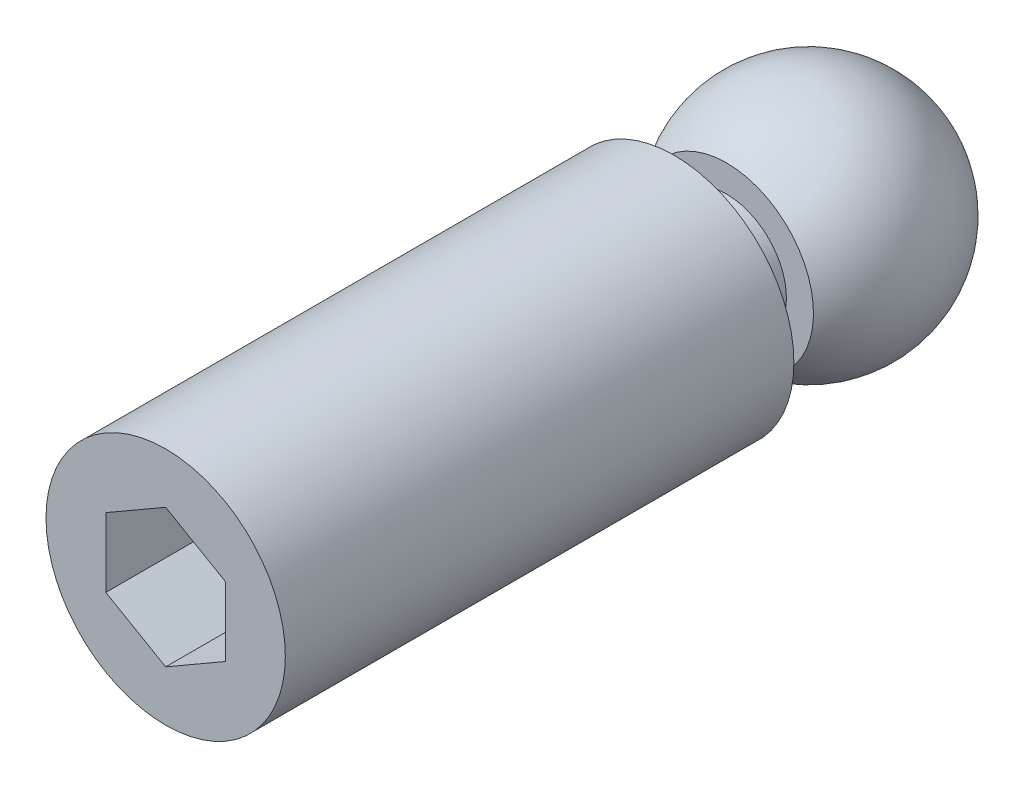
ISO-10303-21;
HEADER;
FILE_DESCRIPTION(('STEP AP214'),'2;1');
FILE_NAME('part.step','',(''),(''),'','','');
FILE_SCHEMA(('AUTOMOTIVE_DESIGN { 1 0 10303 214 1 1 1 1 }'));
ENDSEC;
DATA;
#1=APPLICATION_CONTEXT('core data for automotive mechanical design processes');
#2=APPLICATION_PROTOCOL_DEFINITION('international standard','automotive_design',2000,#1);
#3=PRODUCT_CONTEXT('',#1,'mechanical');
#4=PRODUCT('Part','Part','',(#3));
#5=PRODUCT_RELATED_PRODUCT_CATEGORY('part','',(#4));
#6=PRODUCT_DEFINITION_FORMATION('','',#4);
#7=PRODUCT_DEFINITION_CONTEXT('part definition',#1,'design');
#8=PRODUCT_DEFINITION('design','',#6,#7);
#9=PRODUCT_DEFINITION_SHAPE('','',#8);
#10=(LENGTH_UNIT() NAMED_UNIT(*) SI_UNIT(.MILLI.,.METRE.));
#11=(NAMED_UNIT(*) PLANE_ANGLE_UNIT() SI_UNIT($,.RADIAN.));
#12=(NAMED_UNIT(*) SI_UNIT($,.STERADIAN.) SOLID_ANGLE_UNIT());
#13=UNCERTAINTY_MEASURE_WITH_UNIT(LENGTH_MEASURE(1.E-05),#10,'distance_accuracy_value','');
#14=(GEOMETRIC_REPRESENTATION_CONTEXT(3) GLOBAL_UNCERTAINTY_ASSIGNED_CONTEXT((#13)) GLOBAL_UNIT_ASSIGNED_CONTEXT((#10,
#11,#12)) REPRESENTATION_CONTEXT('',''));
#15=CARTESIAN_POINT('',(0.,0.,0.));
#16=DIRECTION('',(0.,0.,1.));
#17=DIRECTION('',(1.,0.,0.));
#18=AXIS2_PLACEMENT_3D('',#15,#16,#17);
#19=CARTESIAN_POINT('',(0.,0.,8.));
#20=DIRECTION('',(0.,-1.,0.));
#21=DIRECTION('',(-1.,0.,0.));
#22=AXIS2_PLACEMENT_3D('',#19,#20,#21);
#23=SPHERICAL_SURFACE('',#22,8.);
#24=CARTESIAN_POINT('',(0.,0.,8.));
#25=DIRECTION('',(0.,0.,1.));
#26=DIRECTION('',(0.,1.,0.));
#27=AXIS2_PLACEMENT_3D('',#24,#25,#26);
#28=SPHERICAL_SURFACE('',#27,8.);
#29=CARTESIAN_POINT('',(0.,0.,13.5));
#30=DIRECTION('',(0.,0.,1.));
#31=DIRECTION('',(0.,1.,0.));
#32=AXIS2_PLACEMENT_3D('',#29,#30,#31);
#33=CIRCLE('',#32,5.80947501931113);
#34=CARTESIAN_POINT('',(0.,5.80947501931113,13.5));
#35=VERTEX_POINT('',#34);
#36=EDGE_CURVE('E9',#35,#35,#33,.T.);
#37=ORIENTED_EDGE('',*,*,#36,.F.);
#38=EDGE_LOOP('',(#37));
#39=FACE_BOUND('',#38,.T.);
#40=ADVANCED_FACE('F14',(#39),#28,.T.);
#41=CARTESIAN_POINT('',(0.,-5.80947501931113,13.5));
#42=DIRECTION('',(0.,0.,-1.));
#43=DIRECTION('',(0.,-1.,0.));
#44=AXIS2_PLACEMENT_3D('',#41,#42,#43);
#45=PLANE('',#44);
#46=CARTESIAN_POINT('',(0.,0.,13.5));
#47=DIRECTION('',(0.,0.,1.));
#48=DIRECTION('',(0.,1.,0.));
#49=AXIS2_PLACEMENT_3D('',#46,#47,#48);
#50=CIRCLE('',#49,4.);
#51=CARTESIAN_POINT('',(0.,4.,13.5));
#52=VERTEX_POINT('',#51);
#53=EDGE_CURVE('E21',#52,#52,#50,.T.);
#54=ORIENTED_EDGE('',*,*,#53,.F.);
#55=EDGE_LOOP('',(#54));
#56=FACE_BOUND('',#55,.T.);
#57=ORIENTED_EDGE('',*,*,#36,.T.);
#58=EDGE_LOOP('',(#57));
#59=FACE_BOUND('',#58,.T.);
#60=ADVANCED_FACE('F134',(#56,#59),#45,.F.);
#61=CARTESIAN_POINT('',(0.,0.,8.3));
#62=DIRECTION('',(0.,0.,1.));
#63=DIRECTION('',(0.,1.,0.));
#64=AXIS2_PLACEMENT_3D('',#61,#62,#63);
#65=CYLINDRICAL_SURFACE('',#64,4.);
#66=ORIENTED_EDGE('',*,*,#53,.T.);
#67=EDGE_LOOP('',(#66));
#68=FACE_BOUND('',#67,.T.);
#69=CARTESIAN_POINT('',(0.,0.,17.));
#70=DIRECTION('',(0.,0.,1.));
#71=DIRECTION('',(0.,1.,0.));
#72=AXIS2_PLACEMENT_3D('',#69,#70,#71);
#73=CIRCLE('',#72,4.);
#74=CARTESIAN_POINT('',(0.,4.,17.));
#75=VERTEX_POINT('',#74);
#76=EDGE_CURVE('E126',#75,#75,#73,.T.);
#77=ORIENTED_EDGE('',*,*,#76,.F.);
#78=EDGE_LOOP('',(#77));
#79=FACE_BOUND('',#78,.T.);
#80=ADVANCED_FACE('F131',(#68,#79),#65,.T.);
#81=CARTESIAN_POINT('',(0.,-8.,17.));
#82=DIRECTION('',(0.,0.,-1.));
#83=DIRECTION('',(0.,-1.,0.));
#84=AXIS2_PLACEMENT_3D('',#81,#82,#83);
#85=PLANE('',#84);
#86=ORIENTED_EDGE('',*,*,#76,.T.);
#87=EDGE_LOOP('',(#86));
#88=FACE_BOUND('',#87,.T.);
#89=CARTESIAN_POINT('',(0.,0.,17.));
#90=DIRECTION('',(0.,0.,1.));
#91=DIRECTION('',(0.,1.,0.));
#92=AXIS2_PLACEMENT_3D('',#89,#90,#91);
#93=CIRCLE('',#92,8.);
#94=CARTESIAN_POINT('',(0.,8.,17.));
#95=VERTEX_POINT('',#94);
#96=EDGE_CURVE('E123',#95,#95,#93,.T.);
#97=ORIENTED_EDGE('',*,*,#96,.F.);
#98=EDGE_LOOP('',(#97));
#99=FACE_BOUND('',#98,.T.);
#100=ADVANCED_FACE('F157',(#88,#99),#85,.T.);
#101=CARTESIAN_POINT('',(0.,0.,8.3));
#102=DIRECTION('',(0.,0.,1.));
#103=DIRECTION('',(0.,1.,0.));
#104=AXIS2_PLACEMENT_3D('',#101,#102,#103);
#105=CYLINDRICAL_SURFACE('',#104,8.);
#106=ORIENTED_EDGE('',*,*,#96,.T.);
#107=EDGE_LOOP('',(#106));
#108=FACE_BOUND('',#107,.T.);
#109=CARTESIAN_POINT('',(0.,0.,51.));
#110=DIRECTION('',(0.,0.,1.));
#111=DIRECTION('',(0.,1.,0.));
#112=AXIS2_PLACEMENT_3D('',#109,#110,#111);
#113=CIRCLE('',#112,8.);
#114=CARTESIAN_POINT('',(0.,8.,51.));
#115=VERTEX_POINT('',#114);
#116=EDGE_CURVE('E115',#115,#115,#113,.T.);
#117=ORIENTED_EDGE('',*,*,#116,.F.);
#118=EDGE_LOOP('',(#117));
#119=FACE_BOUND('',#118,.T.);
#120=ADVANCED_FACE('F165',(#108,#119),#105,.T.);
#121=CARTESIAN_POINT('',(0.,0.,51.));
#122=DIRECTION('',(0.,0.,1.));
#123=DIRECTION('',(0.,1.,0.));
#124=AXIS2_PLACEMENT_3D('',#121,#122,#123);
#125=PLANE('',#124);
#126=DIRECTION('',(-0.866025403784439,0.5,0.));
#127=VECTOR('',#126,1.);
#128=CARTESIAN_POINT('',(4.,2.30940107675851,51.));
#129=LINE('',#128,#127);
#130=CARTESIAN_POINT('',(4.,2.30940107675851,51.));
#131=VERTEX_POINT('',#130);
#132=CARTESIAN_POINT('',(0.,4.61880215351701,51.));
#133=VERTEX_POINT('',#132);
#134=EDGE_CURVE('E28',#131,#133,#129,.T.);
#135=ORIENTED_EDGE('',*,*,#134,.F.);
#136=DIRECTION('',(0.,1.,0.));
#137=VECTOR('',#136,1.);
#138=CARTESIAN_POINT('',(4.,-2.30940107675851,51.));
#139=LINE('',#138,#137);
#140=CARTESIAN_POINT('',(4.,-2.30940107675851,51.));
#141=VERTEX_POINT('',#140);
#142=EDGE_CURVE('E111',#141,#131,#139,.T.);
#143=ORIENTED_EDGE('',*,*,#142,.F.);
#144=DIRECTION('',(0.866025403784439,0.5,0.));
#145=VECTOR('',#144,1.);
#146=CARTESIAN_POINT('',(0.,-4.61880215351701,51.));
#147=LINE('',#146,#145);
#148=CARTESIAN_POINT('',(0.,-4.61880215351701,51.));
#149=VERTEX_POINT('',#148);
#150=EDGE_CURVE('E109',#149,#141,#147,.T.);
#151=ORIENTED_EDGE('',*,*,#150,.F.);
#152=DIRECTION('',(0.866025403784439,-0.5,0.));
#153=VECTOR('',#152,1.);
#154=CARTESIAN_POINT('',(-4.,-2.30940107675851,51.));
#155=LINE('',#154,#153);
#156=CARTESIAN_POINT('',(-4.,-2.30940107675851,51.));
#157=VERTEX_POINT('',#156);
#158=EDGE_CURVE('E76',#157,#149,#155,.T.);
#159=ORIENTED_EDGE('',*,*,#158,.F.);
#160=DIRECTION('',(0.,-1.,0.));
#161=VECTOR('',#160,1.);
#162=CARTESIAN_POINT('',(-4.,2.30940107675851,51.));
#163=LINE('',#162,#161);
#164=CARTESIAN_POINT('',(-4.,2.30940107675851,51.));
#165=VERTEX_POINT('',#164);
#166=EDGE_CURVE('E105',#165,#157,#163,.T.);
#167=ORIENTED_EDGE('',*,*,#166,.F.);
#168=DIRECTION('',(-0.866025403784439,-0.5,0.));
#169=VECTOR('',#168,1.);
#170=CARTESIAN_POINT('',(0.,4.61880215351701,51.));
#171=LINE('',#170,#169);
#172=EDGE_CURVE('E102',#133,#165,#171,.T.);
#173=ORIENTED_EDGE('',*,*,#172,.F.);
#174=EDGE_LOOP('',(#135,#143,#151,#159,#167,#173));
#175=FACE_BOUND('',#174,.T.);
#176=ORIENTED_EDGE('',*,*,#116,.T.);
#177=EDGE_LOOP('',(#176));
#178=FACE_BOUND('',#177,.T.);
#179=ADVANCED_FACE('F174',(#175,#178),#125,.T.);
#180=CARTESIAN_POINT('',(4.,2.30940107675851,41.));
#181=DIRECTION('',(0.5,0.866025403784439,0.));
#182=DIRECTION('',(-0.866025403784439,0.5,0.));
#183=AXIS2_PLACEMENT_3D('',#180,#181,#182);
#184=PLANE('',#183);
#185=ORIENTED_EDGE('',*,*,#134,.T.);
#186=DIRECTION('',(0.,0.,1.));
#187=VECTOR('',#186,1.);
#188=CARTESIAN_POINT('',(0.,4.61880215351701,41.));
#189=LINE('',#188,#187);
#190=CARTESIAN_POINT('',(0.,4.61880215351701,41.));
#191=VERTEX_POINT('',#190);
#192=EDGE_CURVE('E58',#191,#133,#189,.T.);
#193=ORIENTED_EDGE('',*,*,#192,.F.);
#194=DIRECTION('',(-0.866025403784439,0.5,0.));
#195=VECTOR('',#194,1.);
#196=CARTESIAN_POINT('',(4.,2.30940107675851,41.));
#197=LINE('',#196,#195);
#198=CARTESIAN_POINT('',(4.,2.30940107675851,41.));
#199=VERTEX_POINT('',#198);
#200=EDGE_CURVE('E113',#199,#191,#197,.T.);
#201=ORIENTED_EDGE('',*,*,#200,.F.);
#202=DIRECTION('',(0.,0.,1.));
#203=VECTOR('',#202,1.);
#204=CARTESIAN_POINT('',(4.,2.30940107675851,41.));
#205=LINE('',#204,#203);
#206=EDGE_CURVE('E36',#199,#131,#205,.T.);
#207=ORIENTED_EDGE('',*,*,#206,.T.);
#208=EDGE_LOOP('',(#185,#193,#201,#207));
#209=FACE_BOUND('',#208,.T.);
#210=ADVANCED_FACE('F183',(#209),#184,.F.);
#211=CARTESIAN_POINT('',(4.,-2.30940107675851,41.));
#212=DIRECTION('',(1.,0.,0.));
#213=DIRECTION('',(0.,1.,0.));
#214=AXIS2_PLACEMENT_3D('',#211,#212,#213);
#215=PLANE('',#214);
#216=ORIENTED_EDGE('',*,*,#142,.T.);
#217=ORIENTED_EDGE('',*,*,#206,.F.);
#218=DIRECTION('',(0.,1.,0.));
#219=VECTOR('',#218,1.);
#220=CARTESIAN_POINT('',(4.,-2.30940107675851,41.));
#221=LINE('',#220,#219);
#222=CARTESIAN_POINT('',(4.,-2.30940107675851,41.));
#223=VERTEX_POINT('',#222);
#224=EDGE_CURVE('E88',#223,#199,#221,.T.);
#225=ORIENTED_EDGE('',*,*,#224,.F.);
#226=DIRECTION('',(0.,0.,1.));
#227=VECTOR('',#226,1.);
#228=CARTESIAN_POINT('',(4.,-2.30940107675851,41.));
#229=LINE('',#228,#227);
#230=EDGE_CURVE('E80',#223,#141,#229,.T.);
#231=ORIENTED_EDGE('',*,*,#230,.T.);
#232=EDGE_LOOP('',(#216,#217,#225,#231));
#233=FACE_BOUND('',#232,.T.);
#234=ADVANCED_FACE('F192',(#233),#215,.F.);
#235=CARTESIAN_POINT('',(0.,-4.61880215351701,41.));
#236=DIRECTION('',(0.5,-0.866025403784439,0.));
#237=DIRECTION('',(0.866025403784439,0.5,0.));
#238=AXIS2_PLACEMENT_3D('',#235,#236,#237);
#239=PLANE('',#238);
#240=ORIENTED_EDGE('',*,*,#150,.T.);
#241=ORIENTED_EDGE('',*,*,#230,.F.);
#242=DIRECTION('',(0.866025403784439,0.5,0.));
#243=VECTOR('',#242,1.);
#244=CARTESIAN_POINT('',(0.,-4.61880215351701,41.));
#245=LINE('',#244,#243);
#246=CARTESIAN_POINT('',(0.,-4.61880215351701,41.));
#247=VERTEX_POINT('',#246);
#248=EDGE_CURVE('E84',#247,#223,#245,.T.);
#249=ORIENTED_EDGE('',*,*,#248,.F.);
#250=DIRECTION('',(0.,0.,1.));
#251=VECTOR('',#250,1.);
#252=CARTESIAN_POINT('',(0.,-4.61880215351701,41.));
#253=LINE('',#252,#251);
#254=EDGE_CURVE('E69',#247,#149,#253,.T.);
#255=ORIENTED_EDGE('',*,*,#254,.T.);
#256=EDGE_LOOP('',(#240,#241,#249,#255));
#257=FACE_BOUND('',#256,.T.);
#258=ADVANCED_FACE('F85',(#257),#239,.F.);
#259=CARTESIAN_POINT('',(-4.,-2.30940107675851,41.));
#260=DIRECTION('',(-0.5,-0.866025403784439,0.));
#261=DIRECTION('',(0.866025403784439,-0.5,0.));
#262=AXIS2_PLACEMENT_3D('',#259,#260,#261);
#263=PLANE('',#262);
#264=ORIENTED_EDGE('',*,*,#158,.T.);
#265=ORIENTED_EDGE('',*,*,#254,.F.);
#266=DIRECTION('',(0.866025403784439,-0.5,0.));
#267=VECTOR('',#266,1.);
#268=CARTESIAN_POINT('',(-4.,-2.30940107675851,41.));
#269=LINE('',#268,#267);
#270=CARTESIAN_POINT('',(-4.,-2.30940107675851,41.));
#271=VERTEX_POINT('',#270);
#272=EDGE_CURVE('E73',#271,#247,#269,.T.);
#273=ORIENTED_EDGE('',*,*,#272,.F.);
#274=DIRECTION('',(0.,0.,1.));
#275=VECTOR('',#274,1.);
#276=CARTESIAN_POINT('',(-4.,-2.30940107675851,41.));
#277=LINE('',#276,#275);
#278=EDGE_CURVE('E81',#271,#157,#277,.T.);
#279=ORIENTED_EDGE('',*,*,#278,.T.);
#280=EDGE_LOOP('',(#264,#265,#273,#279));
#281=FACE_BOUND('',#280,.T.);
#282=ADVANCED_FACE('F71',(#281),#263,.F.);
#283=CARTESIAN_POINT('',(-4.,2.30940107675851,41.));
#284=DIRECTION('',(-1.,0.,0.));
#285=DIRECTION('',(0.,0.,1.));
#286=AXIS2_PLACEMENT_3D('',#283,#284,#285);
#287=PLANE('',#286);
#288=ORIENTED_EDGE('',*,*,#166,.T.);
#289=ORIENTED_EDGE('',*,*,#278,.F.);
#290=DIRECTION('',(0.,-1.,0.));
#291=VECTOR('',#290,1.);
#292=CARTESIAN_POINT('',(-4.,2.30940107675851,41.));
#293=LINE('',#292,#291);
#294=CARTESIAN_POINT('',(-4.,2.30940107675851,41.));
#295=VERTEX_POINT('',#294);
#296=EDGE_CURVE('E94',#295,#271,#293,.T.);
#297=ORIENTED_EDGE('',*,*,#296,.F.);
#298=DIRECTION('',(0.,0.,1.));
#299=VECTOR('',#298,1.);
#300=CARTESIAN_POINT('',(-4.,2.30940107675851,41.));
#301=LINE('',#300,#299);
#302=EDGE_CURVE('E118',#295,#165,#301,.T.);
#303=ORIENTED_EDGE('',*,*,#302,.T.);
#304=EDGE_LOOP('',(#288,#289,#297,#303));
#305=FACE_BOUND('',#304,.T.);
#306=ADVANCED_FACE('F214',(#305),#287,.F.);
#307=CARTESIAN_POINT('',(0.,4.61880215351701,41.));
#308=DIRECTION('',(-0.5,0.866025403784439,0.));
#309=DIRECTION('',(-0.866025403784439,-0.5,0.));
#310=AXIS2_PLACEMENT_3D('',#307,#308,#309);
#311=PLANE('',#310);
#312=ORIENTED_EDGE('',*,*,#172,.T.);
#313=ORIENTED_EDGE('',*,*,#302,.F.);
#314=DIRECTION('',(-0.866025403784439,-0.5,0.));
#315=VECTOR('',#314,1.);
#316=CARTESIAN_POINT('',(0.,4.61880215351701,41.));
#317=LINE('',#316,#315);
#318=EDGE_CURVE('E96',#191,#295,#317,.T.);
#319=ORIENTED_EDGE('',*,*,#318,.F.);
#320=ORIENTED_EDGE('',*,*,#192,.T.);
#321=EDGE_LOOP('',(#312,#313,#319,#320));
#322=FACE_BOUND('',#321,.T.);
#323=ADVANCED_FACE('F222',(#322),#311,.F.);
#324=CARTESIAN_POINT('',(0.,4.61880215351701,41.));
#325=DIRECTION('',(0.,0.,1.));
#326=DIRECTION('',(1.,0.,0.));
#327=AXIS2_PLACEMENT_3D('',#324,#325,#326);
#328=PLANE('',#327);
#329=ORIENTED_EDGE('',*,*,#200,.T.);
#330=ORIENTED_EDGE('',*,*,#318,.T.);
#331=ORIENTED_EDGE('',*,*,#296,.T.);
#332=ORIENTED_EDGE('',*,*,#272,.T.);
#333=ORIENTED_EDGE('',*,*,#248,.T.);
#334=ORIENTED_EDGE('',*,*,#224,.T.);
#335=EDGE_LOOP('',(#329,#330,#331,#332,#333,#334));
#336=FACE_BOUND('',#335,.T.);
#337=ADVANCED_FACE('F91',(#336),#328,.T.);
#338=CLOSED_SHELL('',(#40,#60,#80,#100,#120,#179,#210,#234,#258,#282,#306,#323,#337));
#339=MANIFOLD_SOLID_BREP('B1',#338);
#340=ADVANCED_BREP_SHAPE_REPRESENTATION('',(#18,#339),#14);
#341=SHAPE_DEFINITION_REPRESENTATION(#9,#340);
ENDSEC;
END-ISO-10303-21;
